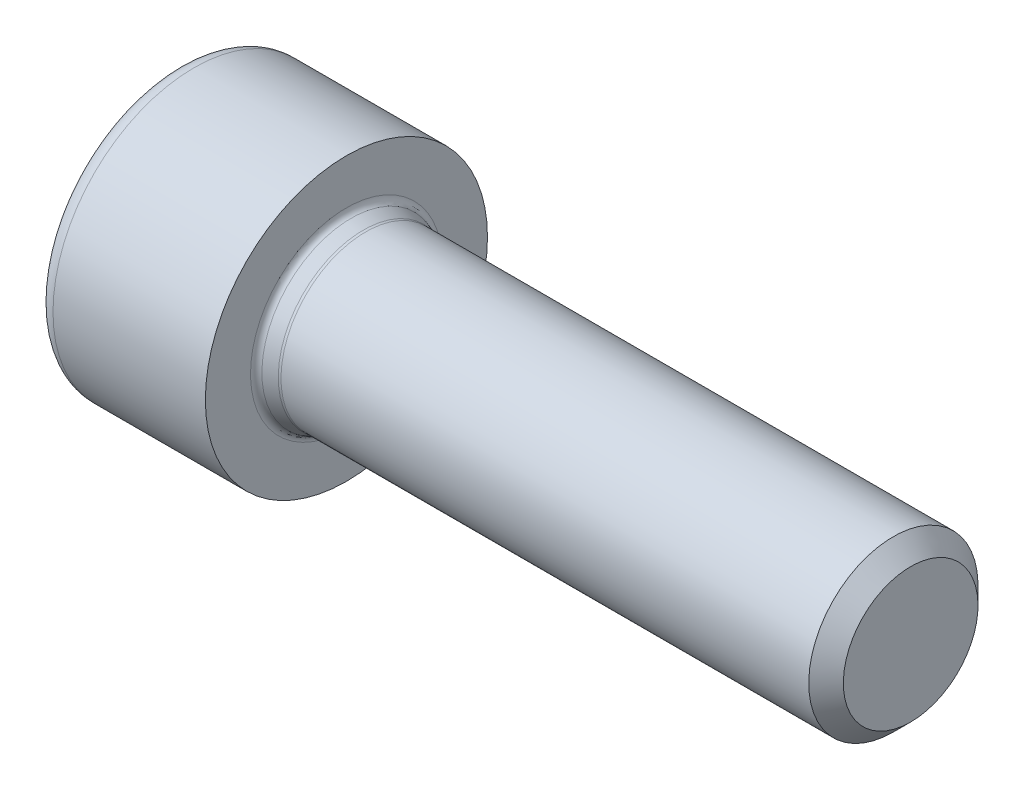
ISO-10303-21;
HEADER;
FILE_DESCRIPTION(('STEP AP214'),'2;1');
FILE_NAME('part.step','',(''),(''),'','','');
FILE_SCHEMA(('AUTOMOTIVE_DESIGN { 1 0 10303 214 1 1 1 1 }'));
ENDSEC;
DATA;
#1=APPLICATION_CONTEXT('core data for automotive mechanical design processes');
#2=APPLICATION_PROTOCOL_DEFINITION('international standard','automotive_design',2000,#1);
#3=PRODUCT_CONTEXT('',#1,'mechanical');
#4=PRODUCT('Part','Part','',(#3));
#5=PRODUCT_RELATED_PRODUCT_CATEGORY('part','',(#4));
#6=PRODUCT_DEFINITION_FORMATION('','',#4);
#7=PRODUCT_DEFINITION_CONTEXT('part definition',#1,'design');
#8=PRODUCT_DEFINITION('design','',#6,#7);
#9=PRODUCT_DEFINITION_SHAPE('','',#8);
#10=(LENGTH_UNIT() NAMED_UNIT(*) SI_UNIT(.MILLI.,.METRE.));
#11=(NAMED_UNIT(*) PLANE_ANGLE_UNIT() SI_UNIT($,.RADIAN.));
#12=(NAMED_UNIT(*) SI_UNIT($,.STERADIAN.) SOLID_ANGLE_UNIT());
#13=UNCERTAINTY_MEASURE_WITH_UNIT(LENGTH_MEASURE(1.E-05),#10,'distance_accuracy_value','');
#14=(GEOMETRIC_REPRESENTATION_CONTEXT(3) GLOBAL_UNCERTAINTY_ASSIGNED_CONTEXT((#13)) GLOBAL_UNIT_ASSIGNED_CONTEXT((#10,
#11,#12)) REPRESENTATION_CONTEXT('',''));
#15=CARTESIAN_POINT('',(0.,0.,0.));
#16=DIRECTION('',(0.,0.,1.));
#17=DIRECTION('',(1.,0.,0.));
#18=AXIS2_PLACEMENT_3D('',#15,#16,#17);
#19=CARTESIAN_POINT('',(-6.,0.,0.));
#20=DIRECTION('',(-1.,0.,0.));
#21=DIRECTION('',(0.,-1.,0.));
#22=AXIS2_PLACEMENT_3D('',#19,#20,#21);
#23=CONICAL_SURFACE('',#22,2.86000000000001,0.785398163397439);
#24=CARTESIAN_POINT('',(-6.,0.,0.));
#25=DIRECTION('',(-1.,0.,0.));
#26=DIRECTION('',(0.,-1.,0.));
#27=AXIS2_PLACEMENT_3D('',#24,#25,#26);
#28=CIRCLE('',#27,2.86000000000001);
#29=CARTESIAN_POINT('',(-6.,1.47051329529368,2.45299625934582));
#30=VERTEX_POINT('',#29);
#31=CARTESIAN_POINT('',(-6.,2.85961372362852,0.0470037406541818));
#32=VERTEX_POINT('',#31);
#33=EDGE_CURVE('E290',#30,#32,#28,.T.);
#34=ORIENTED_EDGE('',*,*,#33,.T.);
#35=CARTESIAN_POINT('',(-6.0002,2.85981958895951,0.0466471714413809));
#36=CARTESIAN_POINT('',(-5.9535581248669,2.8117797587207,0.129854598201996));
#37=CARTESIAN_POINT('',(-5.90977996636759,2.76295285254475,0.214425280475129));
#38=CARTESIAN_POINT('',(-5.82984876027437,2.66348007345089,0.38671718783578));
#39=CARTESIAN_POINT('',(-5.79373670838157,2.61282603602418,0.474452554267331));
#40=CARTESIAN_POINT('',(-5.73201914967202,2.51070463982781,0.651332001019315));
#41=CARTESIAN_POINT('',(-5.7062683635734,2.45925985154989,0.740436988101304));
#42=CARTESIAN_POINT('',(-5.66674232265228,2.35531480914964,0.920475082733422));
#43=CARTESIAN_POINT('',(-5.65294024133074,2.30281719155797,1.01140362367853));
#44=CARTESIAN_POINT('',(-5.64046950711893,2.21102353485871,1.17039490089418));
#45=CARTESIAN_POINT('',(-5.63880967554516,2.17182546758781,1.23828794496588));
#46=CARTESIAN_POINT('',(-5.6428692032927,2.09351034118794,1.37393372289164));
#47=CARTESIAN_POINT('',(-5.64859105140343,2.05439331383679,1.44168640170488));
#48=CARTESIAN_POINT('',(-5.66708669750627,1.9765471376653,1.57651993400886));
#49=CARTESIAN_POINT('',(-5.67986731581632,1.93781840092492,1.64360007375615));
#50=CARTESIAN_POINT('',(-5.71178546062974,1.86103794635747,1.77658772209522));
#51=CARTESIAN_POINT('',(-5.73092243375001,1.82298616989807,1.84249533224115));
#52=CARTESIAN_POINT('',(-5.78438808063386,1.73101321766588,2.00179715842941));
#53=CARTESIAN_POINT('',(-5.82169163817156,1.67752371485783,2.09444369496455));
#54=CARTESIAN_POINT('',(-5.88419452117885,1.59873239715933,2.23091426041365));
#55=CARTESIAN_POINT('',(-5.90608259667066,1.57274677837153,2.27592267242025));
#56=CARTESIAN_POINT('',(-5.95177212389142,1.52121042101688,2.36518626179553));
#57=CARTESIAN_POINT('',(-5.9755728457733,1.49565952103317,2.40944171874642));
#58=CARTESIAN_POINT('',(-6.00020000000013,1.47030742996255,2.45335282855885));
#59=B_SPLINE_CURVE_WITH_KNOTS('',3,(#35,#36,#37,#38,#39,#40,#41,#42,#43,#44,#45,#46,#47,#48,#49,
#50,#51,#52,#53,#54,#55,#56,#57,#58),.UNSPECIFIED.,.F.,.F.,(4,2,2,2,2,2,2,2,2,2,2,4),(0.,
0.320611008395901,0.642895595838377,0.96048909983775,1.2773676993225,1.51227477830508,
1.74726107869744,1.98247482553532,2.21766810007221,2.55697541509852,2.7261255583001,
2.89521145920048),.UNSPECIFIED.);
#60=EDGE_CURVE('E254',#32,#30,#59,.T.);
#61=ORIENTED_EDGE('',*,*,#60,.T.);
#62=EDGE_LOOP('',(#34,#61));
#63=FACE_BOUND('',#62,.T.);
#64=ADVANCED_FACE('F39',(#63),#23,.F.);
#65=CARTESIAN_POINT('',(-6.,2.85961372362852,-0.0470037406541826));
#66=VERTEX_POINT('',#65);
#67=CARTESIAN_POINT('',(-6.,1.47051329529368,-2.45299625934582));
#68=VERTEX_POINT('',#67);
#69=EDGE_CURVE('E293',#66,#68,#28,.T.);
#70=ORIENTED_EDGE('',*,*,#69,.T.);
#71=CARTESIAN_POINT('',(-6.00020000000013,1.47030742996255,-2.45335282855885));
#72=CARTESIAN_POINT('',(-5.95355812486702,1.51834726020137,-2.37014540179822));
#73=CARTESIAN_POINT('',(-5.90977996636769,1.56717416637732,-2.28557471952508));
#74=CARTESIAN_POINT('',(-5.82984876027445,1.6666469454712,-2.1132828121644));
#75=CARTESIAN_POINT('',(-5.79373670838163,1.71730098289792,-2.02554744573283));
#76=CARTESIAN_POINT('',(-5.73201914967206,1.81942237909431,-1.84866799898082));
#77=CARTESIAN_POINT('',(-5.70626836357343,1.87086716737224,-1.75956301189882));
#78=CARTESIAN_POINT('',(-5.6667423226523,1.9748122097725,-1.57952491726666));
#79=CARTESIAN_POINT('',(-5.65294024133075,2.02730982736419,-1.48859637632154));
#80=CARTESIAN_POINT('',(-5.64046950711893,2.11910348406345,-1.32960509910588));
#81=CARTESIAN_POINT('',(-5.63880967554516,2.15830155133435,-1.26171205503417));
#82=CARTESIAN_POINT('',(-5.6428692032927,2.23661667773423,-1.12606627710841));
#83=CARTESIAN_POINT('',(-5.64859105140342,2.27573370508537,-1.05831359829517));
#84=CARTESIAN_POINT('',(-5.66708669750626,2.35357988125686,-0.923480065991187));
#85=CARTESIAN_POINT('',(-5.67986731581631,2.39230861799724,-0.856399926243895));
#86=CARTESIAN_POINT('',(-5.71178546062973,2.4690890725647,-0.723412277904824));
#87=CARTESIAN_POINT('',(-5.73092243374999,2.50714084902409,-0.657504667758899));
#88=CARTESIAN_POINT('',(-5.78438808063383,2.59911380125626,-0.498202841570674));
#89=CARTESIAN_POINT('',(-5.82169163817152,2.6526033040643,-0.40555630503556));
#90=CARTESIAN_POINT('',(-5.88419452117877,2.73139462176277,-0.26908573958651));
#91=CARTESIAN_POINT('',(-5.90608259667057,2.75738024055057,-0.224077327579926));
#92=CARTESIAN_POINT('',(-5.95177212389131,2.8089165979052,-0.134813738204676));
#93=CARTESIAN_POINT('',(-5.97557284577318,2.8344674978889,-0.0905582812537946));
#94=CARTESIAN_POINT('',(-6.0002,2.85981958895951,-0.0466471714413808));
#95=B_SPLINE_CURVE_WITH_KNOTS('',3,(#71,#72,#73,#74,#75,#76,#77,#78,#79,#80,#81,#82,#83,#84,#85,
#86,#87,#88,#89,#90,#91,#92,#93,#94),.UNSPECIFIED.,.F.,.F.,(4,2,2,2,2,2,2,2,2,2,2,4),(0.,
0.320611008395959,0.642895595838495,0.960489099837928,1.27736769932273,1.51227477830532,
1.74726107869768,1.98247482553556,2.21766810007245,2.55697541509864,2.72612555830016,
2.89521145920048),.UNSPECIFIED.);
#96=EDGE_CURVE('E248',#68,#66,#95,.T.);
#97=ORIENTED_EDGE('',*,*,#96,.T.);
#98=EDGE_LOOP('',(#70,#97));
#99=FACE_BOUND('',#98,.T.);
#100=ADVANCED_FACE('F281',(#99),#23,.F.);
#101=CARTESIAN_POINT('',(-6.,1.38910042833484,-2.5));
#102=VERTEX_POINT('',#101);
#103=CARTESIAN_POINT('',(-6.,-1.38910042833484,-2.5));
#104=VERTEX_POINT('',#103);
#105=EDGE_CURVE('E298',#102,#104,#28,.T.);
#106=ORIENTED_EDGE('',*,*,#105,.T.);
#107=CARTESIAN_POINT('',(-7.04621429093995,-3.00141801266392,-2.5));
#108=CARTESIAN_POINT('',(-6.99047801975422,-2.92886338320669,-2.5));
#109=CARTESIAN_POINT('',(-6.9352441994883,-2.85591659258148,-2.5));
#110=CARTESIAN_POINT('',(-6.82601065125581,-2.70907883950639,-2.5));
#111=CARTESIAN_POINT('',(-6.77201121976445,-2.63518765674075,-2.5));
#112=CARTESIAN_POINT('',(-6.66509132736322,-2.48576117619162,-2.5));
#113=CARTESIAN_POINT('',(-6.61218241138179,-2.41021759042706,-2.5));
#114=CARTESIAN_POINT('',(-6.5082160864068,-2.25787105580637,-2.5));
#115=CARTESIAN_POINT('',(-6.45715854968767,-2.18106819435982,-2.5));
#116=CARTESIAN_POINT('',(-6.3541679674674,-2.02110271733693,-2.5));
#117=CARTESIAN_POINT('',(-6.30238273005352,-1.93784445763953,-2.5));
#118=CARTESIAN_POINT('',(-6.20205686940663,-1.76939822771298,-2.5));
#119=CARTESIAN_POINT('',(-6.1535158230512,-1.6842105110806,-2.5));
#120=CARTESIAN_POINT('',(-6.06068920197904,-1.51184789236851,-2.5));
#121=CARTESIAN_POINT('',(-6.0163917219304,-1.42467945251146,-2.5));
#122=CARTESIAN_POINT('',(-5.93305281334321,-1.24788511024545,-2.5));
#123=CARTESIAN_POINT('',(-5.89400891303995,-1.15826038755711,-2.5));
#124=CARTESIAN_POINT('',(-5.82606501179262,-0.985211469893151,-2.5));
#125=CARTESIAN_POINT('',(-5.79654772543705,-0.902032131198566,-2.5));
#126=CARTESIAN_POINT('',(-5.74417210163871,-0.733563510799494,-2.5));
#127=CARTESIAN_POINT('',(-5.72131419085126,-0.648274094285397,-2.5));
#128=CARTESIAN_POINT('',(-5.68387189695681,-0.477574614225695,-2.5));
#129=CARTESIAN_POINT('',(-5.66913793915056,-0.39219791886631,-2.5));
#130=CARTESIAN_POINT('',(-5.6482493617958,-0.220395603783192,-2.5));
#131=CARTESIAN_POINT('',(-5.64209298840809,-0.133970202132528,-2.5));
#132=CARTESIAN_POINT('',(-5.63887861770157,0.035326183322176,-2.5));
#133=CARTESIAN_POINT('',(-5.64144035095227,0.118190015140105,-2.5));
#134=CARTESIAN_POINT('',(-5.65465041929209,0.283265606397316,-2.5));
#135=CARTESIAN_POINT('',(-5.66529949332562,0.365477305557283,-2.5));
#136=CARTESIAN_POINT('',(-5.69426404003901,0.530049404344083,-2.5));
#137=CARTESIAN_POINT('',(-5.71271446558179,0.612385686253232,-2.5));
#138=CARTESIAN_POINT('',(-5.7562642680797,0.775238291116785,-2.5));
#139=CARTESIAN_POINT('',(-5.78136325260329,0.855754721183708,-2.5));
#140=CARTESIAN_POINT('',(-5.86831710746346,1.1039679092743,-2.5));
#141=CARTESIAN_POINT('',(-5.93984988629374,1.26828520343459,-2.5));
#142=CARTESIAN_POINT('',(-6.05916987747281,1.50877129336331,-2.5));
#143=CARTESIAN_POINT('',(-6.10103936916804,1.58808256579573,-2.5));
#144=CARTESIAN_POINT('',(-6.18802346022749,1.74490949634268,-2.5));
#145=CARTESIAN_POINT('',(-6.23313748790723,1.82242546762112,-2.5));
#146=CARTESIAN_POINT('',(-6.32366670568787,1.97208112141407,-2.5));
#147=CARTESIAN_POINT('',(-6.3689569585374,2.04429724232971,-2.5));
#148=CARTESIAN_POINT('',(-6.46146491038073,2.18749040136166,-2.5));
#149=CARTESIAN_POINT('',(-6.50868275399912,2.25846734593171,-2.5));
#150=CARTESIAN_POINT('',(-6.60431609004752,2.39877145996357,-2.5));
#151=CARTESIAN_POINT('',(-6.6527189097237,2.46810730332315,-2.5));
#152=CARTESIAN_POINT('',(-6.75082091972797,2.6058280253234,-2.5));
#153=CARTESIAN_POINT('',(-6.80051974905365,2.67421316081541,-2.5));
#154=CARTESIAN_POINT('',(-6.85074916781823,2.74219973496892,-2.5));
#155=B_SPLINE_CURVE_WITH_KNOTS('',3,(#107,#108,#109,#110,#111,#112,#113,#114,#115,#116,#117,
#118,#119,#120,#121,#122,#123,#124,#125,#126,#127,#128,#129,#130,#131,#132,#133,#134,#135,#136,
#137,#138,#139,#140,#141,#142,#143,#144,#145,#146,#147,#148,#149,#150,#151,#152,#153,#154),
.UNSPECIFIED.,.F.,.F.,(4,2,2,2,2,2,2,2,2,2,2,2,2,2,2,2,2,2,2,2,2,2,2,4),(0.,0.274479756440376,
0.549024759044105,0.825688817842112,1.10233375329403,1.39642312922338,1.69047407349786,
1.98367429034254,2.27673607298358,2.54129169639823,2.80586426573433,3.06538746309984,
3.32485758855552,3.57315770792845,3.82148051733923,4.07428704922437,4.32707866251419,
4.86305553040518,5.13208661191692,5.40107040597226,5.65676835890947,5.912485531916,
6.16614786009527,6.41974027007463),.UNSPECIFIED.);
#156=EDGE_CURVE('E241',#104,#102,#155,.T.);
#157=ORIENTED_EDGE('',*,*,#156,.T.);
#158=EDGE_LOOP('',(#106,#157));
#159=FACE_BOUND('',#158,.T.);
#160=ADVANCED_FACE('F286',(#159),#23,.F.);
#161=CARTESIAN_POINT('',(-6.,-1.47051329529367,-2.45299625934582));
#162=VERTEX_POINT('',#161);
#163=CARTESIAN_POINT('',(-6.,-2.85961372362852,-0.0470037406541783));
#164=VERTEX_POINT('',#163);
#165=EDGE_CURVE('E303',#162,#164,#28,.T.);
#166=ORIENTED_EDGE('',*,*,#165,.T.);
#167=CARTESIAN_POINT('',(-6.0002,-2.85981958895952,-0.0466471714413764));
#168=CARTESIAN_POINT('',(-5.9535581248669,-2.8117797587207,-0.129854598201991));
#169=CARTESIAN_POINT('',(-5.90977996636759,-2.76295285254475,-0.214425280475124));
#170=CARTESIAN_POINT('',(-5.82984876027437,-2.66348007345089,-0.386717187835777));
#171=CARTESIAN_POINT('',(-5.79373670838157,-2.61282603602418,-0.474452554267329));
#172=CARTESIAN_POINT('',(-5.73201914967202,-2.51070463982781,-0.651332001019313));
#173=CARTESIAN_POINT('',(-5.7062683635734,-2.45925985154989,-0.740436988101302));
#174=CARTESIAN_POINT('',(-5.66674232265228,-2.35531480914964,-0.920475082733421));
#175=CARTESIAN_POINT('',(-5.65294024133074,-2.30281719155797,-1.01140362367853));
#176=CARTESIAN_POINT('',(-5.64046950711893,-2.21102353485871,-1.17039490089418));
#177=CARTESIAN_POINT('',(-5.63880967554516,-2.17182546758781,-1.23828794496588));
#178=CARTESIAN_POINT('',(-5.6428692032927,-2.09351034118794,-1.37393372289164));
#179=CARTESIAN_POINT('',(-5.64859105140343,-2.05439331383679,-1.44168640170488));
#180=CARTESIAN_POINT('',(-5.66708669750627,-1.9765471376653,-1.57651993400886));
#181=CARTESIAN_POINT('',(-5.67986731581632,-1.93781840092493,-1.64360007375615));
#182=CARTESIAN_POINT('',(-5.71178546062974,-1.86103794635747,-1.77658772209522));
#183=CARTESIAN_POINT('',(-5.73092243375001,-1.82298616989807,-1.84249533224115));
#184=CARTESIAN_POINT('',(-5.78438808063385,-1.73101321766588,-2.00179715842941));
#185=CARTESIAN_POINT('',(-5.82169163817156,-1.67752371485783,-2.09444369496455));
#186=CARTESIAN_POINT('',(-5.88419452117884,-1.59873239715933,-2.23091426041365));
#187=CARTESIAN_POINT('',(-5.90608259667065,-1.57274677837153,-2.27592267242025));
#188=CARTESIAN_POINT('',(-5.95177212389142,-1.52121042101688,-2.36518626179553));
#189=CARTESIAN_POINT('',(-5.9755728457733,-1.49565952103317,-2.40944171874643));
#190=CARTESIAN_POINT('',(-6.00020000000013,-1.47030742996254,-2.45335282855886));
#191=B_SPLINE_CURVE_WITH_KNOTS('',3,(#167,#168,#169,#170,#171,#172,#173,#174,#175,#176,#177,
#178,#179,#180,#181,#182,#183,#184,#185,#186,#187,#188,#189,#190),.UNSPECIFIED.,.F.,.F.,(4,2,2,
2,2,2,2,2,2,2,2,4),(0.,0.320611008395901,0.64289559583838,0.960489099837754,1.2773676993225,
1.51227477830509,1.74726107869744,1.98247482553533,2.21766810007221,2.55697541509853,
2.72612555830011,2.89521145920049),.UNSPECIFIED.);
#192=EDGE_CURVE('E234',#164,#162,#191,.T.);
#193=ORIENTED_EDGE('',*,*,#192,.T.);
#194=EDGE_LOOP('',(#166,#193));
#195=FACE_BOUND('',#194,.T.);
#196=ADVANCED_FACE('F455',(#195),#23,.F.);
#197=CARTESIAN_POINT('',(-6.,-2.85961372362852,0.0470037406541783));
#198=VERTEX_POINT('',#197);
#199=CARTESIAN_POINT('',(-6.,-1.47051329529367,2.45299625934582));
#200=VERTEX_POINT('',#199);
#201=EDGE_CURVE('E296',#198,#200,#28,.T.);
#202=ORIENTED_EDGE('',*,*,#201,.T.);
#203=CARTESIAN_POINT('',(-6.00020000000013,-1.47030742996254,2.45335282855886));
#204=CARTESIAN_POINT('',(-5.95355812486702,-1.51834726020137,2.37014540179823));
#205=CARTESIAN_POINT('',(-5.90977996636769,-1.56717416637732,2.28557471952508));
#206=CARTESIAN_POINT('',(-5.82984876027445,-1.6666469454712,2.1132828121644));
#207=CARTESIAN_POINT('',(-5.79373670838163,-1.71730098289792,2.02554744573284));
#208=CARTESIAN_POINT('',(-5.73201914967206,-1.8194223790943,1.84866799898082));
#209=CARTESIAN_POINT('',(-5.70626836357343,-1.87086716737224,1.75956301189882));
#210=CARTESIAN_POINT('',(-5.66674232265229,-1.9748122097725,1.57952491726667));
#211=CARTESIAN_POINT('',(-5.65294024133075,-2.02730982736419,1.48859637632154));
#212=CARTESIAN_POINT('',(-5.64046950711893,-2.11910348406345,1.32960509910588));
#213=CARTESIAN_POINT('',(-5.63880967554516,-2.15830155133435,1.26171205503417));
#214=CARTESIAN_POINT('',(-5.6428692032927,-2.23661667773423,1.12606627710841));
#215=CARTESIAN_POINT('',(-5.64859105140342,-2.27573370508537,1.05831359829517));
#216=CARTESIAN_POINT('',(-5.66708669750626,-2.35357988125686,0.923480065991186));
#217=CARTESIAN_POINT('',(-5.67986731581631,-2.39230861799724,0.856399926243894));
#218=CARTESIAN_POINT('',(-5.71178546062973,-2.4690890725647,0.723412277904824));
#219=CARTESIAN_POINT('',(-5.73092243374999,-2.50714084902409,0.657504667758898));
#220=CARTESIAN_POINT('',(-5.78438808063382,-2.59911380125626,0.498202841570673));
#221=CARTESIAN_POINT('',(-5.82169163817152,-2.6526033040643,0.405556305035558));
#222=CARTESIAN_POINT('',(-5.88419452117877,-2.73139462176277,0.269085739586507));
#223=CARTESIAN_POINT('',(-5.90608259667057,-2.75738024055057,0.224077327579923));
#224=CARTESIAN_POINT('',(-5.95177212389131,-2.8089165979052,0.134813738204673));
#225=CARTESIAN_POINT('',(-5.97557284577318,-2.8344674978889,0.0905582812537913));
#226=CARTESIAN_POINT('',(-6.0002,-2.85981958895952,0.0466471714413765));
#227=B_SPLINE_CURVE_WITH_KNOTS('',3,(#203,#204,#205,#206,#207,#208,#209,#210,#211,#212,#213,
#214,#215,#216,#217,#218,#219,#220,#221,#222,#223,#224,#225,#226),.UNSPECIFIED.,.F.,.F.,(4,2,2,
2,2,2,2,2,2,2,2,4),(0.,0.32061100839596,0.642895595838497,0.960489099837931,1.27736769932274,
1.51227477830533,1.74726107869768,1.98247482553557,2.21766810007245,2.55697541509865,
2.72612555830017,2.89521145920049),.UNSPECIFIED.);
#228=EDGE_CURVE('E211',#200,#198,#227,.T.);
#229=ORIENTED_EDGE('',*,*,#228,.T.);
#230=EDGE_LOOP('',(#202,#229));
#231=FACE_BOUND('',#230,.T.);
#232=ADVANCED_FACE('F225',(#231),#23,.F.);
#233=CARTESIAN_POINT('',(-6.,-1.38910042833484,2.5));
#234=VERTEX_POINT('',#233);
#235=CARTESIAN_POINT('',(-6.,1.38910042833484,2.5));
#236=VERTEX_POINT('',#235);
#237=EDGE_CURVE('E292',#234,#236,#28,.T.);
#238=ORIENTED_EDGE('',*,*,#237,.T.);
#239=CARTESIAN_POINT('',(-7.04621429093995,-3.00141801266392,2.5));
#240=CARTESIAN_POINT('',(-6.99047801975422,-2.92886338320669,2.5));
#241=CARTESIAN_POINT('',(-6.9352441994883,-2.85591659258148,2.5));
#242=CARTESIAN_POINT('',(-6.82601065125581,-2.70907883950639,2.5));
#243=CARTESIAN_POINT('',(-6.77201121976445,-2.63518765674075,2.5));
#244=CARTESIAN_POINT('',(-6.66509132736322,-2.48576117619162,2.5));
#245=CARTESIAN_POINT('',(-6.61218241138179,-2.41021759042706,2.5));
#246=CARTESIAN_POINT('',(-6.5082160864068,-2.25787105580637,2.5));
#247=CARTESIAN_POINT('',(-6.45715854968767,-2.18106819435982,2.5));
#248=CARTESIAN_POINT('',(-6.3541679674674,-2.02110271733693,2.5));
#249=CARTESIAN_POINT('',(-6.30238273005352,-1.93784445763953,2.5));
#250=CARTESIAN_POINT('',(-6.20205686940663,-1.76939822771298,2.5));
#251=CARTESIAN_POINT('',(-6.1535158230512,-1.6842105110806,2.5));
#252=CARTESIAN_POINT('',(-6.06068920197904,-1.51184789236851,2.5));
#253=CARTESIAN_POINT('',(-6.0163917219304,-1.42467945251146,2.5));
#254=CARTESIAN_POINT('',(-5.93305281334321,-1.24788511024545,2.5));
#255=CARTESIAN_POINT('',(-5.89400891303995,-1.15826038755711,2.5));
#256=CARTESIAN_POINT('',(-5.82606501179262,-0.985211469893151,2.5));
#257=CARTESIAN_POINT('',(-5.79654772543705,-0.902032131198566,2.5));
#258=CARTESIAN_POINT('',(-5.74417210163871,-0.733563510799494,2.5));
#259=CARTESIAN_POINT('',(-5.72131419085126,-0.648274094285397,2.5));
#260=CARTESIAN_POINT('',(-5.68387189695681,-0.477574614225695,2.5));
#261=CARTESIAN_POINT('',(-5.66913793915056,-0.39219791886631,2.5));
#262=CARTESIAN_POINT('',(-5.6482493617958,-0.220395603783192,2.5));
#263=CARTESIAN_POINT('',(-5.64209298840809,-0.133970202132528,2.5));
#264=CARTESIAN_POINT('',(-5.63887861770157,0.035326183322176,2.5));
#265=CARTESIAN_POINT('',(-5.64144035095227,0.118190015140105,2.5));
#266=CARTESIAN_POINT('',(-5.65465041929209,0.283265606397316,2.5));
#267=CARTESIAN_POINT('',(-5.66529949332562,0.365477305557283,2.5));
#268=CARTESIAN_POINT('',(-5.69426404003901,0.530049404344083,2.5));
#269=CARTESIAN_POINT('',(-5.71271446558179,0.612385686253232,2.5));
#270=CARTESIAN_POINT('',(-5.7562642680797,0.775238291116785,2.5));
#271=CARTESIAN_POINT('',(-5.78136325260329,0.855754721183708,2.5));
#272=CARTESIAN_POINT('',(-5.86831710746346,1.1039679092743,2.5));
#273=CARTESIAN_POINT('',(-5.93984988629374,1.26828520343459,2.5));
#274=CARTESIAN_POINT('',(-6.05916987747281,1.50877129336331,2.5));
#275=CARTESIAN_POINT('',(-6.10103936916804,1.58808256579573,2.5));
#276=CARTESIAN_POINT('',(-6.18802346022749,1.74490949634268,2.5));
#277=CARTESIAN_POINT('',(-6.23313748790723,1.82242546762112,2.5));
#278=CARTESIAN_POINT('',(-6.32366670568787,1.97208112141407,2.5));
#279=CARTESIAN_POINT('',(-6.3689569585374,2.04429724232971,2.5));
#280=CARTESIAN_POINT('',(-6.46146491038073,2.18749040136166,2.5));
#281=CARTESIAN_POINT('',(-6.50868275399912,2.25846734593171,2.5));
#282=CARTESIAN_POINT('',(-6.60431609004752,2.39877145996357,2.5));
#283=CARTESIAN_POINT('',(-6.6527189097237,2.46810730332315,2.5));
#284=CARTESIAN_POINT('',(-6.75082091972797,2.6058280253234,2.5));
#285=CARTESIAN_POINT('',(-6.80051974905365,2.67421316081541,2.5));
#286=CARTESIAN_POINT('',(-6.85074916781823,2.74219973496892,2.5));
#287=B_SPLINE_CURVE_WITH_KNOTS('',3,(#239,#240,#241,#242,#243,#244,#245,#246,#247,#248,#249,
#250,#251,#252,#253,#254,#255,#256,#257,#258,#259,#260,#261,#262,#263,#264,#265,#266,#267,#268,
#269,#270,#271,#272,#273,#274,#275,#276,#277,#278,#279,#280,#281,#282,#283,#284,#285,#286),
.UNSPECIFIED.,.F.,.F.,(4,2,2,2,2,2,2,2,2,2,2,2,2,2,2,2,2,2,2,2,2,2,2,4),(0.,0.274479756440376,
0.549024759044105,0.825688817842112,1.10233375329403,1.39642312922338,1.69047407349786,
1.98367429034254,2.27673607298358,2.54129169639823,2.80586426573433,3.06538746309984,
3.32485758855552,3.57315770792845,3.82148051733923,4.07428704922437,4.32707866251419,
4.86305553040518,5.13208661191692,5.40107040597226,5.65676835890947,5.912485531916,
6.16614786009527,6.41974027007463),.UNSPECIFIED.);
#288=EDGE_CURVE('E197',#236,#234,#287,.F.);
#289=ORIENTED_EDGE('',*,*,#288,.T.);
#290=EDGE_LOOP('',(#238,#289));
#291=FACE_BOUND('',#290,.T.);
#292=ADVANCED_FACE('F220',(#291),#23,.F.);
#293=CARTESIAN_POINT('',(-6.,2.86000000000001,0.));
#294=DIRECTION('',(1.,0.,0.));
#295=DIRECTION('',(0.,1.,0.));
#296=AXIS2_PLACEMENT_3D('',#293,#294,#295);
#297=PLANE('',#296);
#298=DIRECTION('',(0.,0.5,0.866025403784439));
#299=VECTOR('',#298,1.);
#300=CARTESIAN_POINT('',(-6.,2.8800635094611,-0.0115836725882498));
#301=LINE('',#300,#299);
#302=CARTESIAN_POINT('',(-6.,2.88675134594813,0.));
#303=VERTEX_POINT('',#302);
#304=EDGE_CURVE('E48',#66,#303,#301,.T.);
#305=ORIENTED_EDGE('',*,*,#304,.T.);
#306=DIRECTION('',(0.,-0.5,0.866025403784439));
#307=VECTOR('',#306,1.);
#308=CARTESIAN_POINT('',(-6.,2.8800635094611,0.0115836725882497));
#309=LINE('',#308,#307);
#310=EDGE_CURVE('E11',#303,#32,#309,.T.);
#311=ORIENTED_EDGE('',*,*,#310,.T.);
#312=ORIENTED_EDGE('',*,*,#33,.F.);
#313=CARTESIAN_POINT('',(-6.,1.44337567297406,2.5));
#314=VERTEX_POINT('',#313);
#315=EDGE_CURVE('E50',#30,#314,#309,.T.);
#316=ORIENTED_EDGE('',*,*,#315,.T.);
#317=DIRECTION('',(0.,-1.,0.));
#318=VECTOR('',#317,1.);
#319=CARTESIAN_POINT('',(-6.,2.86000000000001,2.5));
#320=LINE('',#319,#318);
#321=EDGE_CURVE('E172',#314,#236,#320,.T.);
#322=ORIENTED_EDGE('',*,*,#321,.T.);
#323=ORIENTED_EDGE('',*,*,#237,.F.);
#324=CARTESIAN_POINT('',(-6.,-1.44337567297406,2.5));
#325=VERTEX_POINT('',#324);
#326=EDGE_CURVE('E308',#234,#325,#320,.T.);
#327=ORIENTED_EDGE('',*,*,#326,.T.);
#328=DIRECTION('',(0.,-0.5,-0.866025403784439));
#329=VECTOR('',#328,1.);
#330=CARTESIAN_POINT('',(-6.,-1.4500635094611,2.48841632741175));
#331=LINE('',#330,#329);
#332=EDGE_CURVE('E311',#325,#200,#331,.T.);
#333=ORIENTED_EDGE('',*,*,#332,.T.);
#334=ORIENTED_EDGE('',*,*,#201,.F.);
#335=CARTESIAN_POINT('',(-6.,-2.88675134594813,0.));
#336=VERTEX_POINT('',#335);
#337=EDGE_CURVE('E313',#198,#336,#331,.T.);
#338=ORIENTED_EDGE('',*,*,#337,.T.);
#339=DIRECTION('',(0.,0.5,-0.866025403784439));
#340=VECTOR('',#339,1.);
#341=CARTESIAN_POINT('',(-6.,-1.4500635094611,-2.48841632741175));
#342=LINE('',#341,#340);
#343=EDGE_CURVE('E315',#336,#164,#342,.T.);
#344=ORIENTED_EDGE('',*,*,#343,.T.);
#345=ORIENTED_EDGE('',*,*,#165,.F.);
#346=CARTESIAN_POINT('',(-6.,-1.44337567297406,-2.5));
#347=VERTEX_POINT('',#346);
#348=EDGE_CURVE('E317',#162,#347,#342,.T.);
#349=ORIENTED_EDGE('',*,*,#348,.T.);
#350=DIRECTION('',(0.,1.,0.));
#351=VECTOR('',#350,1.);
#352=CARTESIAN_POINT('',(-6.,2.86000000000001,-2.5));
#353=LINE('',#352,#351);
#354=EDGE_CURVE('E318',#347,#104,#353,.T.);
#355=ORIENTED_EDGE('',*,*,#354,.T.);
#356=ORIENTED_EDGE('',*,*,#105,.F.);
#357=CARTESIAN_POINT('',(-6.,1.44337567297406,-2.5));
#358=VERTEX_POINT('',#357);
#359=EDGE_CURVE('E320',#102,#358,#353,.T.);
#360=ORIENTED_EDGE('',*,*,#359,.T.);
#361=EDGE_CURVE('E43',#358,#68,#301,.T.);
#362=ORIENTED_EDGE('',*,*,#361,.T.);
#363=ORIENTED_EDGE('',*,*,#69,.F.);
#364=EDGE_LOOP('',(#305,#311,#312,#316,#322,#323,#327,#333,#334,#338,#344,#345,#349,#355,#356,
#360,#362,#363));
#365=FACE_BOUND('',#364,.T.);
#366=CARTESIAN_POINT('',(-6.,0.,0.));
#367=DIRECTION('',(-1.,0.,0.));
#368=DIRECTION('',(0.,-1.,0.));
#369=AXIS2_PLACEMENT_3D('',#366,#367,#368);
#370=CIRCLE('',#369,4.40000000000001);
#371=CARTESIAN_POINT('',(-6.,-4.40000000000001,0.));
#372=VERTEX_POINT('',#371);
#373=EDGE_CURVE('E304',#372,#372,#370,.T.);
#374=ORIENTED_EDGE('',*,*,#373,.T.);
#375=EDGE_LOOP('',(#374));
#376=FACE_BOUND('',#375,.T.);
#377=ADVANCED_FACE('F224',(#365,#376),#297,.F.);
#378=CARTESIAN_POINT('',(-5.40000000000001,0.,0.));
#379=DIRECTION('',(-1.,0.,0.));
#380=DIRECTION('',(0.,-1.,0.));
#381=AXIS2_PLACEMENT_3D('',#378,#379,#380);
#382=TOROIDAL_SURFACE('',#381,4.40000000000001,0.599999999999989);
#383=ORIENTED_EDGE('',*,*,#373,.F.);
#384=EDGE_LOOP('',(#383));
#385=FACE_BOUND('',#384,.T.);
#386=CARTESIAN_POINT('',(-5.4,0.,0.));
#387=DIRECTION('',(-1.,0.,0.));
#388=DIRECTION('',(0.,-1.,0.));
#389=AXIS2_PLACEMENT_3D('',#386,#387,#388);
#390=CIRCLE('',#389,5.);
#391=CARTESIAN_POINT('',(-5.4,-5.,0.));
#392=VERTEX_POINT('',#391);
#393=EDGE_CURVE('E371',#392,#392,#390,.T.);
#394=ORIENTED_EDGE('',*,*,#393,.T.);
#395=EDGE_LOOP('',(#394));
#396=FACE_BOUND('',#395,.T.);
#397=ADVANCED_FACE('F433',(#385,#396),#382,.T.);
#398=CARTESIAN_POINT('',(28.0066243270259,0.,0.));
#399=DIRECTION('',(-1.,0.,0.));
#400=DIRECTION('',(0.,-1.,0.));
#401=AXIS2_PLACEMENT_3D('',#398,#399,#400);
#402=CYLINDRICAL_SURFACE('',#401,5.);
#403=ORIENTED_EDGE('',*,*,#393,.F.);
#404=EDGE_LOOP('',(#403));
#405=FACE_BOUND('',#404,.T.);
#406=CARTESIAN_POINT('',(0.,0.,0.));
#407=DIRECTION('',(-1.,0.,0.));
#408=DIRECTION('',(0.,-1.,0.));
#409=AXIS2_PLACEMENT_3D('',#406,#407,#408);
#410=CIRCLE('',#409,5.);
#411=CARTESIAN_POINT('',(0.,-5.,0.));
#412=VERTEX_POINT('',#411);
#413=EDGE_CURVE('E374',#412,#412,#410,.T.);
#414=ORIENTED_EDGE('',*,*,#413,.T.);
#415=EDGE_LOOP('',(#414));
#416=FACE_BOUND('',#415,.T.);
#417=ADVANCED_FACE('F430',(#405,#416),#402,.T.);
#418=CARTESIAN_POINT('',(0.,5.,0.));
#419=DIRECTION('',(-1.,0.,0.));
#420=DIRECTION('',(0.,-1.,0.));
#421=AXIS2_PLACEMENT_3D('',#418,#419,#420);
#422=PLANE('',#421);
#423=ORIENTED_EDGE('',*,*,#413,.F.);
#424=EDGE_LOOP('',(#423));
#425=FACE_BOUND('',#424,.T.);
#426=CARTESIAN_POINT('',(0.,0.,0.));
#427=DIRECTION('',(-1.,0.,0.));
#428=DIRECTION('',(0.,-1.,0.));
#429=AXIS2_PLACEMENT_3D('',#426,#427,#428);
#430=CIRCLE('',#429,3.4);
#431=CARTESIAN_POINT('',(0.,-3.4,0.));
#432=VERTEX_POINT('',#431);
#433=EDGE_CURVE('E378',#432,#432,#430,.T.);
#434=ORIENTED_EDGE('',*,*,#433,.T.);
#435=EDGE_LOOP('',(#434));
#436=FACE_BOUND('',#435,.T.);
#437=ADVANCED_FACE('F426',(#425,#436),#422,.F.);
#438=CARTESIAN_POINT('',(0.25,0.,0.));
#439=DIRECTION('',(-1.,0.,0.));
#440=DIRECTION('',(0.,-1.,0.));
#441=AXIS2_PLACEMENT_3D('',#438,#439,#440);
#442=TOROIDAL_SURFACE('',#441,3.4,0.25);
#443=ORIENTED_EDGE('',*,*,#433,.F.);
#444=EDGE_LOOP('',(#443));
#445=FACE_BOUND('',#444,.T.);
#446=CARTESIAN_POINT('',(0.167656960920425,0.,0.));
#447=DIRECTION('',(-1.,0.,0.));
#448=DIRECTION('',(0.,-1.,0.));
#449=AXIS2_PLACEMENT_3D('',#446,#447,#448);
#450=CIRCLE('',#449,3.16394995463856);
#451=CARTESIAN_POINT('',(0.167656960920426,-3.16394995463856,0.));
#452=VERTEX_POINT('',#451);
#453=EDGE_CURVE('E383',#452,#452,#450,.T.);
#454=ORIENTED_EDGE('',*,*,#453,.T.);
#455=EDGE_LOOP('',(#454));
#456=FACE_BOUND('',#455,.T.);
#457=ADVANCED_FACE('F422',(#445,#456),#442,.F.);
#458=CARTESIAN_POINT('',(0.597656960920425,0.,0.));
#459=DIRECTION('',(-1.,0.,0.));
#460=DIRECTION('',(0.,-1.,0.));
#461=AXIS2_PLACEMENT_3D('',#458,#459,#460);
#462=CONICAL_SURFACE('',#461,3.01394995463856,0.335638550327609);
#463=ORIENTED_EDGE('',*,*,#453,.F.);
#464=EDGE_LOOP('',(#463));
#465=FACE_BOUND('',#464,.T.);
#466=CARTESIAN_POINT('',(0.597656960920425,0.,0.));
#467=DIRECTION('',(-1.,0.,0.));
#468=DIRECTION('',(0.,-1.,0.));
#469=AXIS2_PLACEMENT_3D('',#466,#467,#468);
#470=CIRCLE('',#469,3.01394995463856);
#471=CARTESIAN_POINT('',(0.597656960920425,-3.01394995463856,0.));
#472=VERTEX_POINT('',#471);
#473=EDGE_CURVE('E386',#472,#472,#470,.T.);
#474=ORIENTED_EDGE('',*,*,#473,.T.);
#475=EDGE_LOOP('',(#474));
#476=FACE_BOUND('',#475,.T.);
#477=ADVANCED_FACE('F418',(#465,#476),#462,.T.);
#478=CARTESIAN_POINT('',(0.680000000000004,0.,0.));
#479=DIRECTION('',(-1.,0.,0.));
#480=DIRECTION('',(0.,-1.,0.));
#481=AXIS2_PLACEMENT_3D('',#478,#479,#480);
#482=TOROIDAL_SURFACE('',#481,3.25000000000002,0.250000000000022);
#483=ORIENTED_EDGE('',*,*,#473,.F.);
#484=EDGE_LOOP('',(#483));
#485=FACE_BOUND('',#484,.T.);
#486=CARTESIAN_POINT('',(0.68,0.,0.));
#487=DIRECTION('',(-1.,0.,0.));
#488=DIRECTION('',(0.,-1.,0.));
#489=AXIS2_PLACEMENT_3D('',#486,#487,#488);
#490=CIRCLE('',#489,3.);
#491=CARTESIAN_POINT('',(0.68,-3.,0.));
#492=VERTEX_POINT('',#491);
#493=EDGE_CURVE('E389',#492,#492,#490,.T.);
#494=ORIENTED_EDGE('',*,*,#493,.T.);
#495=EDGE_LOOP('',(#494));
#496=FACE_BOUND('',#495,.T.);
#497=ADVANCED_FACE('F414',(#485,#496),#482,.F.);
#498=CARTESIAN_POINT('',(28.0066243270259,0.,0.));
#499=DIRECTION('',(-1.,0.,0.));
#500=DIRECTION('',(0.,-1.,0.));
#501=AXIS2_PLACEMENT_3D('',#498,#499,#500);
#502=CYLINDRICAL_SURFACE('',#501,3.);
#503=ORIENTED_EDGE('',*,*,#493,.F.);
#504=EDGE_LOOP('',(#503));
#505=FACE_BOUND('',#504,.T.);
#506=CARTESIAN_POINT('',(19.3865,0.,0.));
#507=DIRECTION('',(-1.,0.,0.));
#508=DIRECTION('',(0.,-1.,0.));
#509=AXIS2_PLACEMENT_3D('',#506,#507,#508);
#510=CIRCLE('',#509,3.);
#511=CARTESIAN_POINT('',(19.3865,-3.,0.));
#512=VERTEX_POINT('',#511);
#513=EDGE_CURVE('E392',#512,#512,#510,.T.);
#514=ORIENTED_EDGE('',*,*,#513,.T.);
#515=EDGE_LOOP('',(#514));
#516=FACE_BOUND('',#515,.T.);
#517=ADVANCED_FACE('F407',(#505,#516),#502,.T.);
#518=CARTESIAN_POINT('',(20.,0.,0.));
#519=DIRECTION('',(-1.,0.,0.));
#520=DIRECTION('',(0.,-1.,0.));
#521=AXIS2_PLACEMENT_3D('',#518,#519,#520);
#522=CONICAL_SURFACE('',#521,2.3865,0.785398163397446);
#523=ORIENTED_EDGE('',*,*,#513,.F.);
#524=EDGE_LOOP('',(#523));
#525=FACE_BOUND('',#524,.T.);
#526=CARTESIAN_POINT('',(20.,0.,0.));
#527=DIRECTION('',(-1.,0.,0.));
#528=DIRECTION('',(0.,-1.,0.));
#529=AXIS2_PLACEMENT_3D('',#526,#527,#528);
#530=CIRCLE('',#529,2.3865);
#531=CARTESIAN_POINT('',(20.,-2.3865,0.));
#532=VERTEX_POINT('',#531);
#533=EDGE_CURVE('E394',#532,#532,#530,.T.);
#534=ORIENTED_EDGE('',*,*,#533,.T.);
#535=EDGE_LOOP('',(#534));
#536=FACE_BOUND('',#535,.T.);
#537=ADVANCED_FACE('F398',(#525,#536),#522,.T.);
#538=CARTESIAN_POINT('',(20.,2.3865,0.));
#539=DIRECTION('',(-1.,0.,0.));
#540=DIRECTION('',(0.,-1.,0.));
#541=AXIS2_PLACEMENT_3D('',#538,#539,#540);
#542=PLANE('',#541);
#543=ORIENTED_EDGE('',*,*,#533,.F.);
#544=EDGE_LOOP('',(#543));
#545=FACE_BOUND('',#544,.T.);
#546=ADVANCED_FACE('F400',(#545),#542,.F.);
#547=CARTESIAN_POINT('',(-2.3,0.,0.));
#548=DIRECTION('',(1.,0.,0.));
#549=DIRECTION('',(0.,0.,-1.));
#550=AXIS2_PLACEMENT_3D('',#547,#548,#549);
#551=PLANE('',#550);
#552=DIRECTION('',(0.,1.,0.));
#553=VECTOR('',#552,1.);
#554=CARTESIAN_POINT('',(-2.3,-1.44337567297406,-2.5));
#555=LINE('',#554,#553);
#556=CARTESIAN_POINT('',(-2.3,-1.44337567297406,-2.5));
#557=VERTEX_POINT('',#556);
#558=CARTESIAN_POINT('',(-2.3,0.,-2.5));
#559=VERTEX_POINT('',#558);
#560=EDGE_CURVE('E57',#557,#559,#555,.T.);
#561=ORIENTED_EDGE('',*,*,#560,.F.);
#562=DIRECTION('',(0.,0.5,-0.866025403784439));
#563=VECTOR('',#562,1.);
#564=CARTESIAN_POINT('',(-2.3,-2.88675134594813,0.));
#565=LINE('',#564,#563);
#566=CARTESIAN_POINT('',(-2.3,-2.1650635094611,-1.25));
#567=VERTEX_POINT('',#566);
#568=EDGE_CURVE('E186',#567,#557,#565,.T.);
#569=ORIENTED_EDGE('',*,*,#568,.F.);
#570=CARTESIAN_POINT('',(-2.3,0.,0.));
#571=DIRECTION('',(-1.,0.,0.));
#572=DIRECTION('',(0.,-1.,0.));
#573=AXIS2_PLACEMENT_3D('',#570,#571,#572);
#574=CIRCLE('',#573,2.5);
#575=EDGE_CURVE('E355',#559,#567,#574,.T.);
#576=ORIENTED_EDGE('',*,*,#575,.F.);
#577=EDGE_LOOP('',(#561,#569,#576));
#578=FACE_BOUND('',#577,.T.);
#579=ADVANCED_FACE('F266',(#578),#551,.F.);
#580=CARTESIAN_POINT('',(-2.3,-2.88675134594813,0.));
#581=VERTEX_POINT('',#580);
#582=EDGE_CURVE('E187',#581,#567,#565,.T.);
#583=ORIENTED_EDGE('',*,*,#582,.F.);
#584=DIRECTION('',(0.,-0.5,-0.866025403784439));
#585=VECTOR('',#584,1.);
#586=CARTESIAN_POINT('',(-2.3,-1.44337567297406,2.5));
#587=LINE('',#586,#585);
#588=CARTESIAN_POINT('',(-2.3,-2.1650635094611,1.25));
#589=VERTEX_POINT('',#588);
#590=EDGE_CURVE('E178',#589,#581,#587,.T.);
#591=ORIENTED_EDGE('',*,*,#590,.F.);
#592=EDGE_CURVE('E302',#567,#589,#574,.T.);
#593=ORIENTED_EDGE('',*,*,#592,.F.);
#594=EDGE_LOOP('',(#583,#591,#593));
#595=FACE_BOUND('',#594,.T.);
#596=ADVANCED_FACE('F351',(#595),#551,.F.);
#597=CARTESIAN_POINT('',(-2.3,-1.44337567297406,2.5));
#598=VERTEX_POINT('',#597);
#599=EDGE_CURVE('E182',#598,#589,#587,.T.);
#600=ORIENTED_EDGE('',*,*,#599,.F.);
#601=DIRECTION('',(0.,-1.,0.));
#602=VECTOR('',#601,1.);
#603=CARTESIAN_POINT('',(-2.3,1.44337567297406,2.5));
#604=LINE('',#603,#602);
#605=CARTESIAN_POINT('',(-2.3,0.,2.5));
#606=VERTEX_POINT('',#605);
#607=EDGE_CURVE('E179',#606,#598,#604,.T.);
#608=ORIENTED_EDGE('',*,*,#607,.F.);
#609=EDGE_CURVE('E306',#589,#606,#574,.T.);
#610=ORIENTED_EDGE('',*,*,#609,.F.);
#611=EDGE_LOOP('',(#600,#608,#610));
#612=FACE_BOUND('',#611,.T.);
#613=ADVANCED_FACE('F346',(#612),#551,.F.);
#614=CARTESIAN_POINT('',(-2.3,1.44337567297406,2.5));
#615=VERTEX_POINT('',#614);
#616=EDGE_CURVE('E169',#615,#606,#604,.T.);
#617=ORIENTED_EDGE('',*,*,#616,.F.);
#618=DIRECTION('',(0.,-0.5,0.866025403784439));
#619=VECTOR('',#618,1.);
#620=CARTESIAN_POINT('',(-2.3,2.88675134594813,0.));
#621=LINE('',#620,#619);
#622=CARTESIAN_POINT('',(-2.3,2.1650635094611,1.25));
#623=VERTEX_POINT('',#622);
#624=EDGE_CURVE('E155',#623,#615,#621,.T.);
#625=ORIENTED_EDGE('',*,*,#624,.F.);
#626=EDGE_CURVE('E176',#606,#623,#574,.T.);
#627=ORIENTED_EDGE('',*,*,#626,.F.);
#628=EDGE_LOOP('',(#617,#625,#627));
#629=FACE_BOUND('',#628,.T.);
#630=ADVANCED_FACE('F175',(#629),#551,.F.);
#631=CARTESIAN_POINT('',(-2.3,2.88675134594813,0.));
#632=VERTEX_POINT('',#631);
#633=EDGE_CURVE('E162',#632,#623,#621,.T.);
#634=ORIENTED_EDGE('',*,*,#633,.F.);
#635=DIRECTION('',(0.,0.5,0.866025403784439));
#636=VECTOR('',#635,1.);
#637=CARTESIAN_POINT('',(-2.3,1.44337567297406,-2.5));
#638=LINE('',#637,#636);
#639=CARTESIAN_POINT('',(-2.3,2.1650635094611,-1.25));
#640=VERTEX_POINT('',#639);
#641=EDGE_CURVE('E192',#640,#632,#638,.T.);
#642=ORIENTED_EDGE('',*,*,#641,.F.);
#643=EDGE_CURVE('E359',#623,#640,#574,.T.);
#644=ORIENTED_EDGE('',*,*,#643,.F.);
#645=EDGE_LOOP('',(#634,#642,#644));
#646=FACE_BOUND('',#645,.T.);
#647=ADVANCED_FACE('F362',(#646),#551,.F.);
#648=CARTESIAN_POINT('',(-2.3,1.44337567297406,-2.5));
#649=VERTEX_POINT('',#648);
#650=EDGE_CURVE('E173',#649,#640,#638,.T.);
#651=ORIENTED_EDGE('',*,*,#650,.F.);
#652=EDGE_CURVE('E190',#559,#649,#555,.T.);
#653=ORIENTED_EDGE('',*,*,#652,.F.);
#654=EDGE_CURVE('E357',#640,#559,#574,.T.);
#655=ORIENTED_EDGE('',*,*,#654,.F.);
#656=EDGE_LOOP('',(#651,#653,#655));
#657=FACE_BOUND('',#656,.T.);
#658=ADVANCED_FACE('F367',(#657),#551,.F.);
#659=CARTESIAN_POINT('',(-8.3,2.88675134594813,0.));
#660=DIRECTION('',(0.,0.866025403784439,0.5));
#661=DIRECTION('',(0.,-0.5,0.866025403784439));
#662=AXIS2_PLACEMENT_3D('',#659,#660,#661);
#663=PLANE('',#662);
#664=ORIENTED_EDGE('',*,*,#60,.F.);
#665=ORIENTED_EDGE('',*,*,#310,.F.);
#666=DIRECTION('',(1.,0.,0.));
#667=VECTOR('',#666,1.);
#668=CARTESIAN_POINT('',(-8.3,2.88675134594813,0.));
#669=LINE('',#668,#667);
#670=EDGE_CURVE('E195',#303,#632,#669,.T.);
#671=ORIENTED_EDGE('',*,*,#670,.T.);
#672=ORIENTED_EDGE('',*,*,#633,.T.);
#673=ORIENTED_EDGE('',*,*,#624,.T.);
#674=DIRECTION('',(1.,0.,0.));
#675=VECTOR('',#674,1.);
#676=CARTESIAN_POINT('',(-8.3,1.44337567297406,2.5));
#677=LINE('',#676,#675);
#678=EDGE_CURVE('E159',#314,#615,#677,.T.);
#679=ORIENTED_EDGE('',*,*,#678,.F.);
#680=ORIENTED_EDGE('',*,*,#315,.F.);
#681=EDGE_LOOP('',(#664,#665,#671,#672,#673,#679,#680));
#682=FACE_BOUND('',#681,.T.);
#683=ADVANCED_FACE('F157',(#682),#663,.F.);
#684=CARTESIAN_POINT('',(-8.3,1.44337567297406,-2.5));
#685=DIRECTION('',(0.,0.866025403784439,-0.5));
#686=DIRECTION('',(0.,0.5,0.866025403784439));
#687=AXIS2_PLACEMENT_3D('',#684,#685,#686);
#688=PLANE('',#687);
#689=ORIENTED_EDGE('',*,*,#96,.F.);
#690=ORIENTED_EDGE('',*,*,#361,.F.);
#691=DIRECTION('',(1.,0.,0.));
#692=VECTOR('',#691,1.);
#693=CARTESIAN_POINT('',(-8.3,1.44337567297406,-2.5));
#694=LINE('',#693,#692);
#695=EDGE_CURVE('E198',#358,#649,#694,.T.);
#696=ORIENTED_EDGE('',*,*,#695,.T.);
#697=ORIENTED_EDGE('',*,*,#650,.T.);
#698=ORIENTED_EDGE('',*,*,#641,.T.);
#699=ORIENTED_EDGE('',*,*,#670,.F.);
#700=ORIENTED_EDGE('',*,*,#304,.F.);
#701=EDGE_LOOP('',(#689,#690,#696,#697,#698,#699,#700));
#702=FACE_BOUND('',#701,.T.);
#703=ADVANCED_FACE('F260',(#702),#688,.F.);
#704=CARTESIAN_POINT('',(-8.3,-1.44337567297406,-2.5));
#705=DIRECTION('',(0.,0.,-1.));
#706=DIRECTION('',(-1.,0.,0.));
#707=AXIS2_PLACEMENT_3D('',#704,#705,#706);
#708=PLANE('',#707);
#709=ORIENTED_EDGE('',*,*,#156,.F.);
#710=ORIENTED_EDGE('',*,*,#354,.F.);
#711=DIRECTION('',(1.,0.,0.));
#712=VECTOR('',#711,1.);
#713=CARTESIAN_POINT('',(-8.3,-1.44337567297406,-2.5));
#714=LINE('',#713,#712);
#715=EDGE_CURVE('E200',#347,#557,#714,.T.);
#716=ORIENTED_EDGE('',*,*,#715,.T.);
#717=ORIENTED_EDGE('',*,*,#560,.T.);
#718=ORIENTED_EDGE('',*,*,#652,.T.);
#719=ORIENTED_EDGE('',*,*,#695,.F.);
#720=ORIENTED_EDGE('',*,*,#359,.F.);
#721=EDGE_LOOP('',(#709,#710,#716,#717,#718,#719,#720));
#722=FACE_BOUND('',#721,.T.);
#723=ADVANCED_FACE('F264',(#722),#708,.F.);
#724=CARTESIAN_POINT('',(-8.3,-2.88675134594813,0.));
#725=DIRECTION('',(0.,-0.866025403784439,-0.5));
#726=DIRECTION('',(0.,0.5,-0.866025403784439));
#727=AXIS2_PLACEMENT_3D('',#724,#725,#726);
#728=PLANE('',#727);
#729=ORIENTED_EDGE('',*,*,#192,.F.);
#730=ORIENTED_EDGE('',*,*,#343,.F.);
#731=DIRECTION('',(1.,0.,0.));
#732=VECTOR('',#731,1.);
#733=CARTESIAN_POINT('',(-8.3,-2.88675134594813,0.));
#734=LINE('',#733,#732);
#735=EDGE_CURVE('E202',#336,#581,#734,.T.);
#736=ORIENTED_EDGE('',*,*,#735,.T.);
#737=ORIENTED_EDGE('',*,*,#582,.T.);
#738=ORIENTED_EDGE('',*,*,#568,.T.);
#739=ORIENTED_EDGE('',*,*,#715,.F.);
#740=ORIENTED_EDGE('',*,*,#348,.F.);
#741=EDGE_LOOP('',(#729,#730,#736,#737,#738,#739,#740));
#742=FACE_BOUND('',#741,.T.);
#743=ADVANCED_FACE('F269',(#742),#728,.F.);
#744=CARTESIAN_POINT('',(-8.3,-1.44337567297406,2.5));
#745=DIRECTION('',(0.,-0.866025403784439,0.5));
#746=DIRECTION('',(0.,-0.5,-0.866025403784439));
#747=AXIS2_PLACEMENT_3D('',#744,#745,#746);
#748=PLANE('',#747);
#749=ORIENTED_EDGE('',*,*,#228,.F.);
#750=ORIENTED_EDGE('',*,*,#332,.F.);
#751=DIRECTION('',(1.,0.,0.));
#752=VECTOR('',#751,1.);
#753=CARTESIAN_POINT('',(-8.3,-1.44337567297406,2.5));
#754=LINE('',#753,#752);
#755=EDGE_CURVE('E65',#325,#598,#754,.T.);
#756=ORIENTED_EDGE('',*,*,#755,.T.);
#757=ORIENTED_EDGE('',*,*,#599,.T.);
#758=ORIENTED_EDGE('',*,*,#590,.T.);
#759=ORIENTED_EDGE('',*,*,#735,.F.);
#760=ORIENTED_EDGE('',*,*,#337,.F.);
#761=EDGE_LOOP('',(#749,#750,#756,#757,#758,#759,#760));
#762=FACE_BOUND('',#761,.T.);
#763=ADVANCED_FACE('F272',(#762),#748,.F.);
#764=CARTESIAN_POINT('',(-8.3,1.44337567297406,2.5));
#765=DIRECTION('',(0.,0.,1.));
#766=DIRECTION('',(1.,0.,0.));
#767=AXIS2_PLACEMENT_3D('',#764,#765,#766);
#768=PLANE('',#767);
#769=ORIENTED_EDGE('',*,*,#288,.F.);
#770=ORIENTED_EDGE('',*,*,#321,.F.);
#771=ORIENTED_EDGE('',*,*,#678,.T.);
#772=ORIENTED_EDGE('',*,*,#616,.T.);
#773=ORIENTED_EDGE('',*,*,#607,.T.);
#774=ORIENTED_EDGE('',*,*,#755,.F.);
#775=ORIENTED_EDGE('',*,*,#326,.F.);
#776=EDGE_LOOP('',(#769,#770,#771,#772,#773,#774,#775));
#777=FACE_BOUND('',#776,.T.);
#778=ADVANCED_FACE('F168',(#777),#768,.F.);
#779=CARTESIAN_POINT('',(-2.3,0.,0.));
#780=DIRECTION('',(-1.,0.,0.));
#781=DIRECTION('',(0.,-1.,0.));
#782=AXIS2_PLACEMENT_3D('',#779,#780,#781);
#783=CONICAL_SURFACE('',#782,2.5,1.04521253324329);
#784=CARTESIAN_POINT('',(-0.85,0.,0.));
#785=VERTEX_POINT('',#784);
#786=VERTEX_LOOP('',#785);
#787=FACE_BOUND('',#786,.T.);
#788=ORIENTED_EDGE('',*,*,#609,.T.);
#789=ORIENTED_EDGE('',*,*,#626,.T.);
#790=ORIENTED_EDGE('',*,*,#643,.T.);
#791=ORIENTED_EDGE('',*,*,#654,.T.);
#792=ORIENTED_EDGE('',*,*,#575,.T.);
#793=ORIENTED_EDGE('',*,*,#592,.T.);
#794=EDGE_LOOP('',(#788,#789,#790,#791,#792,#793));
#795=FACE_BOUND('',#794,.T.);
#796=ADVANCED_FACE('F41',(#787,#795),#783,.F.);
#797=CLOSED_SHELL('',(#64,#100,#160,#196,#232,#292,#377,#397,#417,#437,#457,#477,#497,#517,#537,
#546,#579,#596,#613,#630,#647,#658,#683,#703,#723,#743,#763,#778,#796));
#798=MANIFOLD_SOLID_BREP('B2',#797);
#799=ADVANCED_BREP_SHAPE_REPRESENTATION('',(#18,#798),#14);
#800=SHAPE_DEFINITION_REPRESENTATION(#9,#799);
ENDSEC;
END-ISO-10303-21;
